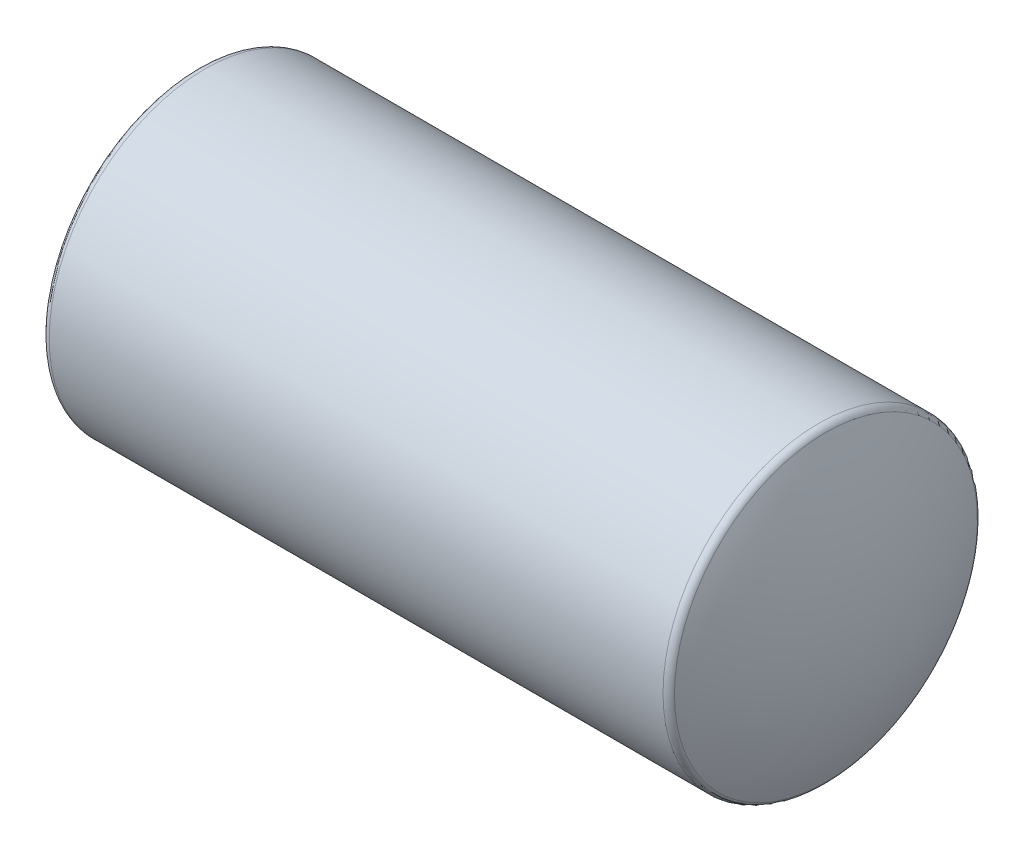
from build123d import *

# Parameters (mm, degrees)
FILLET_1_R = 0.2


with BuildPart() as part:
    # Sketch 1 → Revolve 1 (revolve)
    with BuildSketch(Plane.XY):
        with BuildLine():
            Line((-8.94427191, 0), (8.94427191, 0))
            ThreePointArc((8.94427191, 0), (8.705003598, 2.054972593), (8, 4))
            Line((8, 4), (-8, 4))
            ThreePointArc((-8, 4), (-8.705003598, 2.054972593), (-8.94427191, 0))
        make_face()
    revolve(axis=Axis((-8.94427191, 0, 0), (1, 0, 0)))

    # Fillet 1
    fillet_1_edges = [part.edges().sort_by_distance(p)[0] for p in [
        (-8, -4, 0),
        (8, -4, 0),
    ]]
    fillet(fillet_1_edges, radius=FILLET_1_R)


solid = part.part
